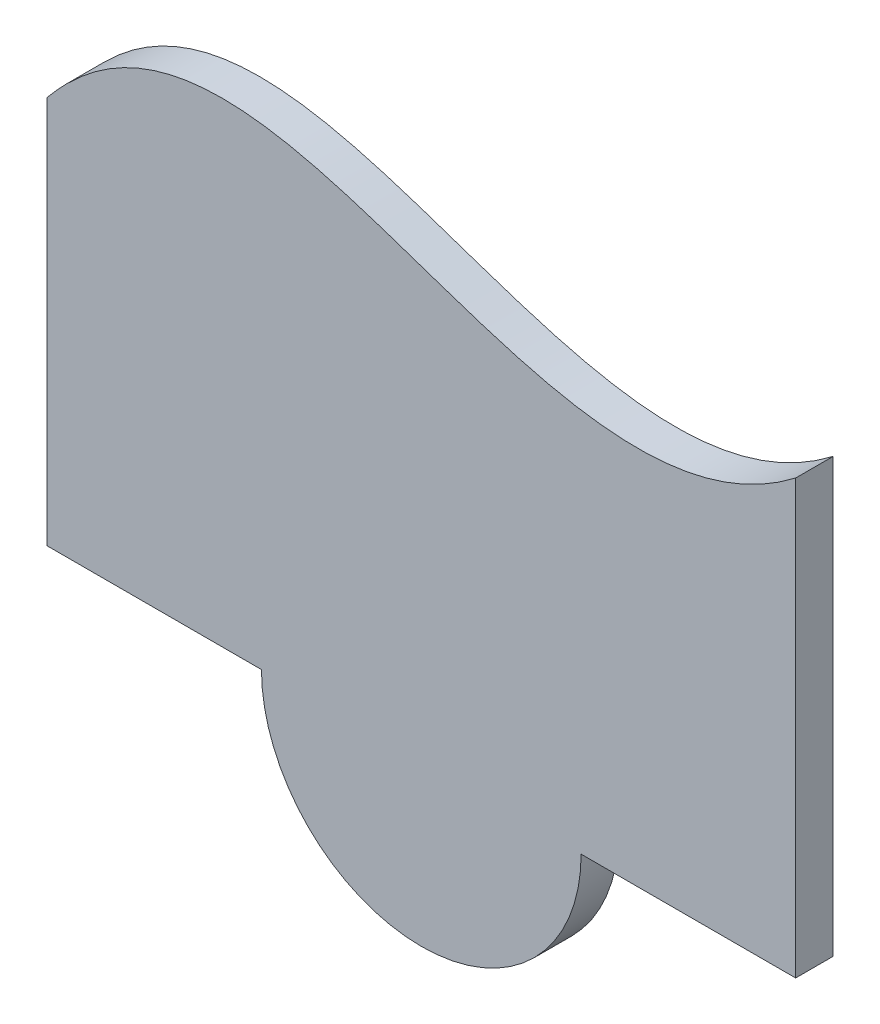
from build123d import *

# Parameters (mm, degrees)
EXTRUDE1_DEPTH = 5


with BuildPart() as part:
    # Sketch1 → Extrude1 (new body)
    with BuildSketch(Plane.XY):
        with BuildLine():
            Line((71.347893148, 0), (100, 0))
            Line((100, 0), (100, 57.829344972))
            add(Edge.make_bspline(
                [(0, 51.821101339), (27.732458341, 85.634420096), (66.97140495, 32.496610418), (100, 57.829344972)],
                knots=[0, 0, 0, 0, 1, 1, 1, 1], degree=3))
            Line((0, 51.821101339), (0, 0))
            Line((0, 0), (28.652106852, 0))
            ThreePointArc((28.652106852, 0), (50, -21.347893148), (71.347893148, 0))
        make_face()
    extrude(amount=EXTRUDE1_DEPTH)


solid = part.part
